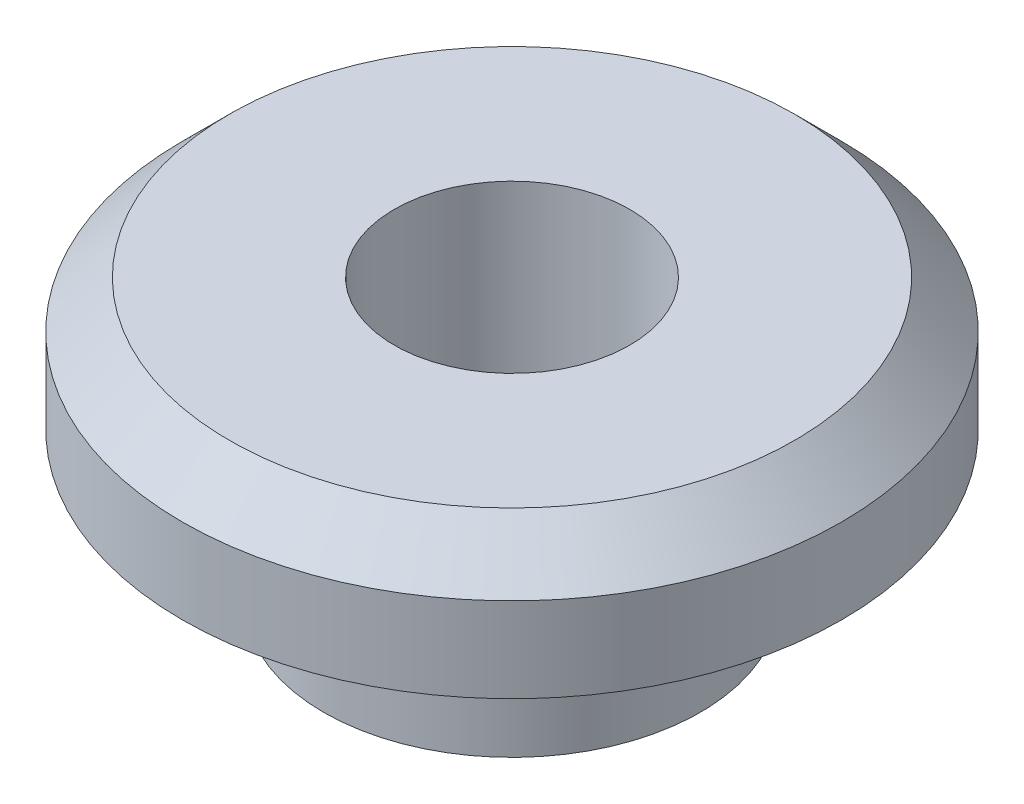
from build123d import *


with BuildPart() as part:
    # Sketch1 → Revolve1 (revolve)
    with BuildSketch(Plane.XY, mode=Mode.PRIVATE) as revolve1_sk:
        Polygon((2.5, 6), (6, 6), (7, 5), (7, 3.2), (4, 3.2), (4, 0), (2.5, 0), align=None)
    revolve(revolve1_sk.sketch.rotate(Axis((0, 0, 0), (0, 1, 0)), 90), axis=Axis((0, 0, 0), (0, 1, 0)))


solid = part.part
